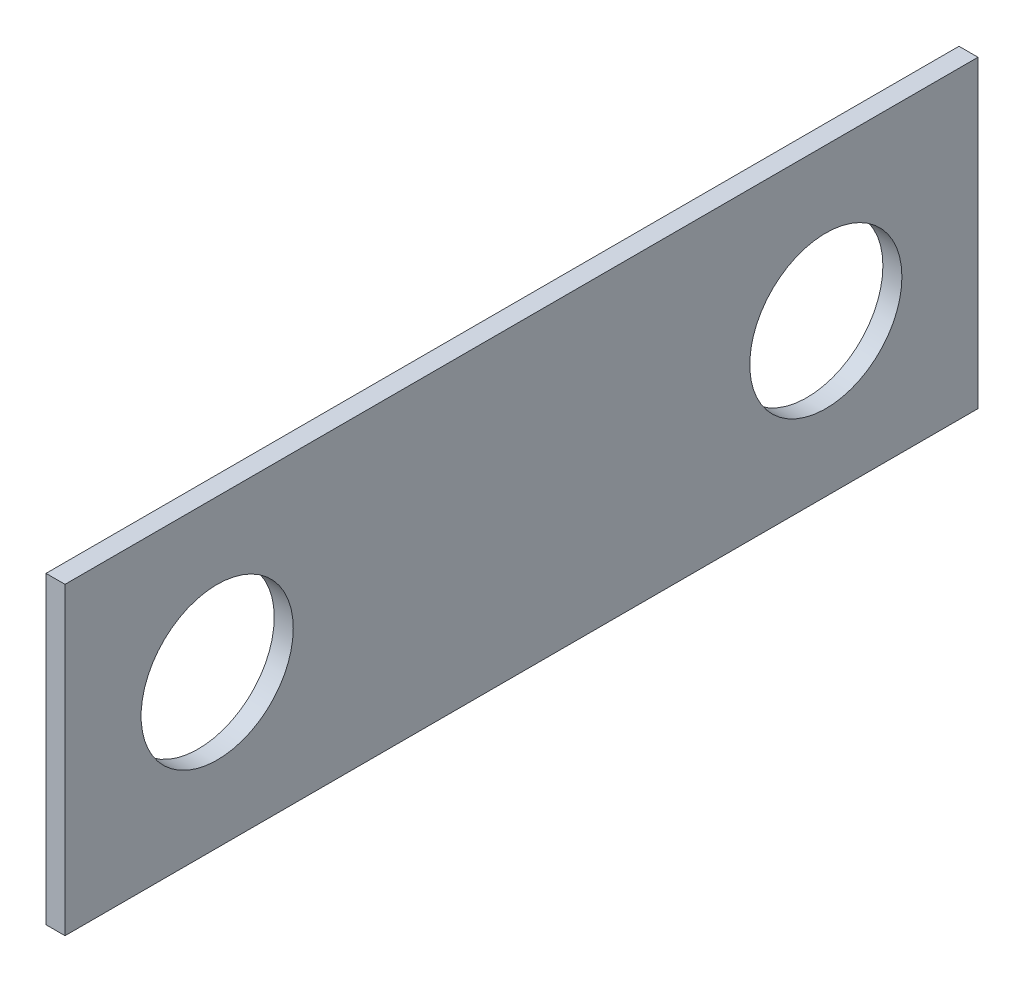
ISO-10303-21;
HEADER;
FILE_DESCRIPTION(('STEP AP214'),'2;1');
FILE_NAME('part.step','',(''),(''),'','','');
FILE_SCHEMA(('AUTOMOTIVE_DESIGN { 1 0 10303 214 1 1 1 1 }'));
ENDSEC;
DATA;
#1=APPLICATION_CONTEXT('core data for automotive mechanical design processes');
#2=APPLICATION_PROTOCOL_DEFINITION('international standard','automotive_design',2000,#1);
#3=PRODUCT_CONTEXT('',#1,'mechanical');
#4=PRODUCT('Part','Part','',(#3));
#5=PRODUCT_RELATED_PRODUCT_CATEGORY('part','',(#4));
#6=PRODUCT_DEFINITION_FORMATION('','',#4);
#7=PRODUCT_DEFINITION_CONTEXT('part definition',#1,'design');
#8=PRODUCT_DEFINITION('design','',#6,#7);
#9=PRODUCT_DEFINITION_SHAPE('','',#8);
#10=(LENGTH_UNIT() NAMED_UNIT(*) SI_UNIT(.MILLI.,.METRE.));
#11=(NAMED_UNIT(*) PLANE_ANGLE_UNIT() SI_UNIT($,.RADIAN.));
#12=(NAMED_UNIT(*) SI_UNIT($,.STERADIAN.) SOLID_ANGLE_UNIT());
#13=UNCERTAINTY_MEASURE_WITH_UNIT(LENGTH_MEASURE(1.E-05),#10,'distance_accuracy_value','');
#14=(GEOMETRIC_REPRESENTATION_CONTEXT(3) GLOBAL_UNCERTAINTY_ASSIGNED_CONTEXT((#13)) GLOBAL_UNIT_ASSIGNED_CONTEXT((#10,
#11,#12)) REPRESENTATION_CONTEXT('',''));
#15=CARTESIAN_POINT('',(0.,0.,0.));
#16=DIRECTION('',(0.,0.,1.));
#17=DIRECTION('',(1.,0.,0.));
#18=AXIS2_PLACEMENT_3D('',#15,#16,#17);
#19=CARTESIAN_POINT('',(0.79375,0.,0.));
#20=DIRECTION('',(-1.,0.,0.));
#21=DIRECTION('',(0.,0.,1.));
#22=AXIS2_PLACEMENT_3D('',#19,#20,#21);
#23=PLANE('',#22);
#24=DIRECTION('',(0.,1.,0.));
#25=VECTOR('',#24,1.);
#26=CARTESIAN_POINT('',(0.79375,-6.35,-19.05));
#27=LINE('',#26,#25);
#28=CARTESIAN_POINT('',(0.79375,-6.35,-19.05));
#29=VERTEX_POINT('',#28);
#30=CARTESIAN_POINT('',(0.79375,6.35,-19.05));
#31=VERTEX_POINT('',#30);
#32=EDGE_CURVE('E98',#29,#31,#27,.T.);
#33=ORIENTED_EDGE('',*,*,#32,.T.);
#34=DIRECTION('',(0.,0.,1.));
#35=VECTOR('',#34,1.);
#36=CARTESIAN_POINT('',(0.79375,6.35,19.05));
#37=LINE('',#36,#35);
#38=CARTESIAN_POINT('',(0.79375,6.35,19.05));
#39=VERTEX_POINT('',#38);
#40=EDGE_CURVE('E93',#31,#39,#37,.T.);
#41=ORIENTED_EDGE('',*,*,#40,.T.);
#42=DIRECTION('',(0.,-1.,0.));
#43=VECTOR('',#42,1.);
#44=CARTESIAN_POINT('',(0.79375,-6.35,19.05));
#45=LINE('',#44,#43);
#46=CARTESIAN_POINT('',(0.79375,-6.35,19.05));
#47=VERTEX_POINT('',#46);
#48=EDGE_CURVE('E96',#39,#47,#45,.T.);
#49=ORIENTED_EDGE('',*,*,#48,.T.);
#50=DIRECTION('',(0.,0.,-1.));
#51=VECTOR('',#50,1.);
#52=CARTESIAN_POINT('',(0.79375,-6.35,19.05));
#53=LINE('',#52,#51);
#54=EDGE_CURVE('E63',#47,#29,#53,.T.);
#55=ORIENTED_EDGE('',*,*,#54,.T.);
#56=EDGE_LOOP('',(#33,#41,#49,#55));
#57=FACE_BOUND('',#56,.T.);
#58=CARTESIAN_POINT('',(0.79375,0.,12.7));
#59=DIRECTION('',(1.,0.,0.));
#60=DIRECTION('',(0.,0.,-1.));
#61=AXIS2_PLACEMENT_3D('',#58,#59,#60);
#62=CIRCLE('',#61,3.175);
#63=CARTESIAN_POINT('',(0.79375,0.,9.525));
#64=VERTEX_POINT('',#63);
#65=EDGE_CURVE('E118',#64,#64,#62,.T.);
#66=ORIENTED_EDGE('',*,*,#65,.F.);
#67=EDGE_LOOP('',(#66));
#68=FACE_BOUND('',#67,.T.);
#69=CARTESIAN_POINT('',(0.79375,0.,-12.7));
#70=DIRECTION('',(1.,0.,0.));
#71=DIRECTION('',(0.,0.,-1.));
#72=AXIS2_PLACEMENT_3D('',#69,#70,#71);
#73=CIRCLE('',#72,3.175);
#74=CARTESIAN_POINT('',(0.79375,0.,-15.875));
#75=VERTEX_POINT('',#74);
#76=EDGE_CURVE('E140',#75,#75,#73,.T.);
#77=ORIENTED_EDGE('',*,*,#76,.F.);
#78=EDGE_LOOP('',(#77));
#79=FACE_BOUND('',#78,.T.);
#80=ADVANCED_FACE('F45',(#57,#68,#79),#23,.F.);
#81=CARTESIAN_POINT('',(0.,0.,0.));
#82=DIRECTION('',(-1.,0.,0.));
#83=DIRECTION('',(0.,0.,1.));
#84=AXIS2_PLACEMENT_3D('',#81,#82,#83);
#85=PLANE('',#84);
#86=CARTESIAN_POINT('',(0.,0.,12.7));
#87=DIRECTION('',(1.,0.,0.));
#88=DIRECTION('',(0.,0.,-1.));
#89=AXIS2_PLACEMENT_3D('',#86,#87,#88);
#90=CIRCLE('',#89,3.175);
#91=CARTESIAN_POINT('',(0.,0.,9.525));
#92=VERTEX_POINT('',#91);
#93=EDGE_CURVE('E136',#92,#92,#90,.T.);
#94=ORIENTED_EDGE('',*,*,#93,.T.);
#95=EDGE_LOOP('',(#94));
#96=FACE_BOUND('',#95,.T.);
#97=DIRECTION('',(0.,1.,0.));
#98=VECTOR('',#97,1.);
#99=CARTESIAN_POINT('',(0.,-6.35,-19.05));
#100=LINE('',#99,#98);
#101=CARTESIAN_POINT('',(0.,-6.35,-19.05));
#102=VERTEX_POINT('',#101);
#103=CARTESIAN_POINT('',(0.,6.35,-19.05));
#104=VERTEX_POINT('',#103);
#105=EDGE_CURVE('E114',#102,#104,#100,.T.);
#106=ORIENTED_EDGE('',*,*,#105,.F.);
#107=DIRECTION('',(0.,0.,-1.));
#108=VECTOR('',#107,1.);
#109=CARTESIAN_POINT('',(0.,-6.35,19.05));
#110=LINE('',#109,#108);
#111=CARTESIAN_POINT('',(0.,-6.35,19.05));
#112=VERTEX_POINT('',#111);
#113=EDGE_CURVE('E86',#112,#102,#110,.T.);
#114=ORIENTED_EDGE('',*,*,#113,.F.);
#115=DIRECTION('',(0.,-1.,0.));
#116=VECTOR('',#115,1.);
#117=CARTESIAN_POINT('',(0.,-6.35,19.05));
#118=LINE('',#117,#116);
#119=CARTESIAN_POINT('',(0.,6.35,19.05));
#120=VERTEX_POINT('',#119);
#121=EDGE_CURVE('E80',#120,#112,#118,.T.);
#122=ORIENTED_EDGE('',*,*,#121,.F.);
#123=DIRECTION('',(0.,0.,1.));
#124=VECTOR('',#123,1.);
#125=CARTESIAN_POINT('',(0.,6.35,19.05));
#126=LINE('',#125,#124);
#127=EDGE_CURVE('E103',#104,#120,#126,.T.);
#128=ORIENTED_EDGE('',*,*,#127,.F.);
#129=EDGE_LOOP('',(#106,#114,#122,#128));
#130=FACE_BOUND('',#129,.T.);
#131=CARTESIAN_POINT('',(0.,0.,-12.7));
#132=DIRECTION('',(1.,0.,0.));
#133=DIRECTION('',(0.,0.,-1.));
#134=AXIS2_PLACEMENT_3D('',#131,#132,#133);
#135=CIRCLE('',#134,3.175);
#136=CARTESIAN_POINT('',(0.,0.,-15.875));
#137=VERTEX_POINT('',#136);
#138=EDGE_CURVE('E144',#137,#137,#135,.T.);
#139=ORIENTED_EDGE('',*,*,#138,.T.);
#140=EDGE_LOOP('',(#139));
#141=FACE_BOUND('',#140,.T.);
#142=ADVANCED_FACE('F131',(#96,#130,#141),#85,.T.);
#143=CARTESIAN_POINT('',(0.79375,-6.35,-19.05));
#144=DIRECTION('',(0.,0.,1.));
#145=DIRECTION('',(0.,-1.,0.));
#146=AXIS2_PLACEMENT_3D('',#143,#144,#145);
#147=PLANE('',#146);
#148=ORIENTED_EDGE('',*,*,#105,.T.);
#149=DIRECTION('',(-1.,0.,0.));
#150=VECTOR('',#149,1.);
#151=CARTESIAN_POINT('',(0.79375,6.35,-19.05));
#152=LINE('',#151,#150);
#153=EDGE_CURVE('E11',#31,#104,#152,.T.);
#154=ORIENTED_EDGE('',*,*,#153,.F.);
#155=ORIENTED_EDGE('',*,*,#32,.F.);
#156=DIRECTION('',(-1.,0.,0.));
#157=VECTOR('',#156,1.);
#158=CARTESIAN_POINT('',(0.79375,-6.35,-19.05));
#159=LINE('',#158,#157);
#160=EDGE_CURVE('E110',#29,#102,#159,.T.);
#161=ORIENTED_EDGE('',*,*,#160,.T.);
#162=EDGE_LOOP('',(#148,#154,#155,#161));
#163=FACE_BOUND('',#162,.T.);
#164=ADVANCED_FACE('F47',(#163),#147,.F.);
#165=CARTESIAN_POINT('',(0.79375,6.35,19.05));
#166=DIRECTION('',(0.,-1.,0.));
#167=DIRECTION('',(0.,0.,-1.));
#168=AXIS2_PLACEMENT_3D('',#165,#166,#167);
#169=PLANE('',#168);
#170=ORIENTED_EDGE('',*,*,#127,.T.);
#171=DIRECTION('',(-1.,0.,0.));
#172=VECTOR('',#171,1.);
#173=CARTESIAN_POINT('',(0.79375,6.35,19.05));
#174=LINE('',#173,#172);
#175=EDGE_CURVE('E55',#39,#120,#174,.T.);
#176=ORIENTED_EDGE('',*,*,#175,.F.);
#177=ORIENTED_EDGE('',*,*,#40,.F.);
#178=ORIENTED_EDGE('',*,*,#153,.T.);
#179=EDGE_LOOP('',(#170,#176,#177,#178));
#180=FACE_BOUND('',#179,.T.);
#181=ADVANCED_FACE('F102',(#180),#169,.F.);
#182=CARTESIAN_POINT('',(0.79375,-6.35,19.05));
#183=DIRECTION('',(0.,0.,-1.));
#184=DIRECTION('',(-1.,0.,0.));
#185=AXIS2_PLACEMENT_3D('',#182,#183,#184);
#186=PLANE('',#185);
#187=ORIENTED_EDGE('',*,*,#121,.T.);
#188=DIRECTION('',(-1.,0.,0.));
#189=VECTOR('',#188,1.);
#190=CARTESIAN_POINT('',(0.79375,-6.35,19.05));
#191=LINE('',#190,#189);
#192=EDGE_CURVE('E105',#47,#112,#191,.T.);
#193=ORIENTED_EDGE('',*,*,#192,.F.);
#194=ORIENTED_EDGE('',*,*,#48,.F.);
#195=ORIENTED_EDGE('',*,*,#175,.T.);
#196=EDGE_LOOP('',(#187,#193,#194,#195));
#197=FACE_BOUND('',#196,.T.);
#198=ADVANCED_FACE('F106',(#197),#186,.F.);
#199=CARTESIAN_POINT('',(0.79375,-6.35,19.05));
#200=DIRECTION('',(0.,1.,0.));
#201=DIRECTION('',(0.,0.,1.));
#202=AXIS2_PLACEMENT_3D('',#199,#200,#201);
#203=PLANE('',#202);
#204=ORIENTED_EDGE('',*,*,#113,.T.);
#205=ORIENTED_EDGE('',*,*,#160,.F.);
#206=ORIENTED_EDGE('',*,*,#54,.F.);
#207=ORIENTED_EDGE('',*,*,#192,.T.);
#208=EDGE_LOOP('',(#204,#205,#206,#207));
#209=FACE_BOUND('',#208,.T.);
#210=ADVANCED_FACE('F128',(#209),#203,.F.);
#211=CARTESIAN_POINT('',(0.79375,0.,12.7));
#212=DIRECTION('',(-1.,0.,0.));
#213=DIRECTION('',(0.,0.,1.));
#214=AXIS2_PLACEMENT_3D('',#211,#212,#213);
#215=CYLINDRICAL_SURFACE('',#214,3.175);
#216=ORIENTED_EDGE('',*,*,#65,.T.);
#217=EDGE_LOOP('',(#216));
#218=FACE_BOUND('',#217,.T.);
#219=ORIENTED_EDGE('',*,*,#93,.F.);
#220=EDGE_LOOP('',(#219));
#221=FACE_BOUND('',#220,.T.);
#222=ADVANCED_FACE('F163',(#218,#221),#215,.F.);
#223=CARTESIAN_POINT('',(0.79375,0.,-12.7));
#224=DIRECTION('',(-1.,0.,0.));
#225=DIRECTION('',(0.,0.,1.));
#226=AXIS2_PLACEMENT_3D('',#223,#224,#225);
#227=CYLINDRICAL_SURFACE('',#226,3.175);
#228=ORIENTED_EDGE('',*,*,#76,.T.);
#229=EDGE_LOOP('',(#228));
#230=FACE_BOUND('',#229,.T.);
#231=ORIENTED_EDGE('',*,*,#138,.F.);
#232=EDGE_LOOP('',(#231));
#233=FACE_BOUND('',#232,.T.);
#234=ADVANCED_FACE('F152',(#230,#233),#227,.F.);
#235=CLOSED_SHELL('',(#80,#142,#164,#181,#198,#210,#222,#234));
#236=MANIFOLD_SOLID_BREP('B2',#235);
#237=ADVANCED_BREP_SHAPE_REPRESENTATION('',(#18,#236),#14);
#238=SHAPE_DEFINITION_REPRESENTATION(#9,#237);
ENDSEC;
END-ISO-10303-21;
